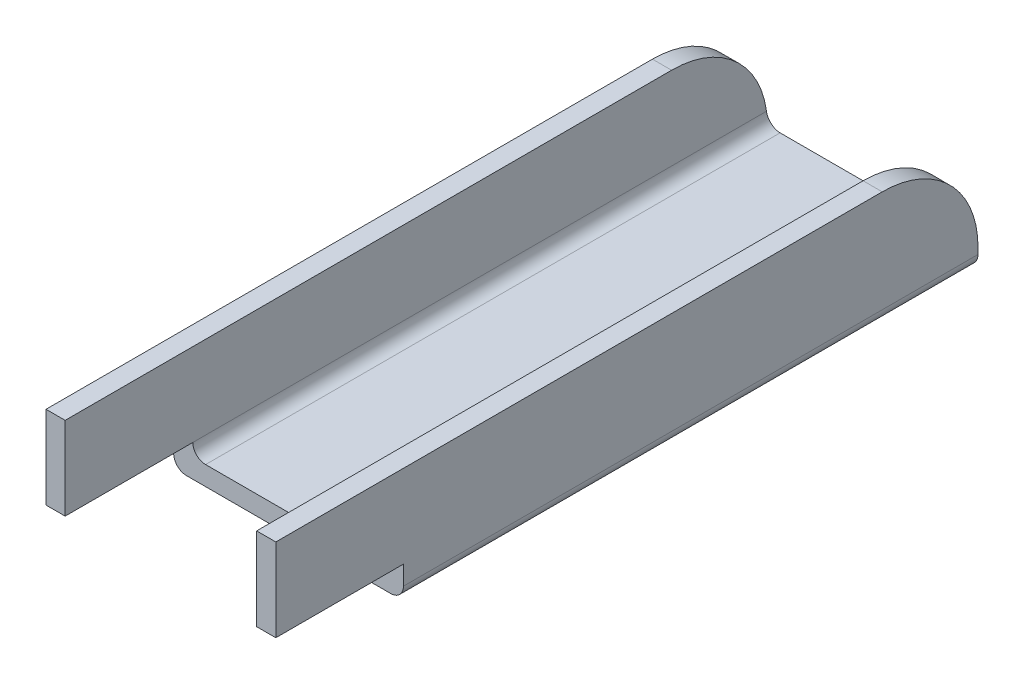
ISO-10303-21;
HEADER;
FILE_DESCRIPTION(('STEP AP214'),'2;1');
FILE_NAME('part.step','',(''),(''),'','','');
FILE_SCHEMA(('AUTOMOTIVE_DESIGN { 1 0 10303 214 1 1 1 1 }'));
ENDSEC;
DATA;
#1=APPLICATION_CONTEXT('core data for automotive mechanical design processes');
#2=APPLICATION_PROTOCOL_DEFINITION('international standard','automotive_design',2000,#1);
#3=PRODUCT_CONTEXT('',#1,'mechanical');
#4=PRODUCT('Part','Part','',(#3));
#5=PRODUCT_RELATED_PRODUCT_CATEGORY('part','',(#4));
#6=PRODUCT_DEFINITION_FORMATION('','',#4);
#7=PRODUCT_DEFINITION_CONTEXT('part definition',#1,'design');
#8=PRODUCT_DEFINITION('design','',#6,#7);
#9=PRODUCT_DEFINITION_SHAPE('','',#8);
#10=(LENGTH_UNIT() NAMED_UNIT(*) SI_UNIT(.MILLI.,.METRE.));
#11=(NAMED_UNIT(*) PLANE_ANGLE_UNIT() SI_UNIT($,.RADIAN.));
#12=(NAMED_UNIT(*) SI_UNIT($,.STERADIAN.) SOLID_ANGLE_UNIT());
#13=UNCERTAINTY_MEASURE_WITH_UNIT(LENGTH_MEASURE(1.E-05),#10,'distance_accuracy_value','');
#14=(GEOMETRIC_REPRESENTATION_CONTEXT(3) GLOBAL_UNCERTAINTY_ASSIGNED_CONTEXT((#13)) GLOBAL_UNIT_ASSIGNED_CONTEXT((#10,
#11,#12)) REPRESENTATION_CONTEXT('',''));
#15=CARTESIAN_POINT('',(0.,0.,0.));
#16=DIRECTION('',(0.,0.,1.));
#17=DIRECTION('',(1.,0.,0.));
#18=AXIS2_PLACEMENT_3D('',#15,#16,#17);
#19=CARTESIAN_POINT('',(33.,15.,0.));
#20=DIRECTION('',(0.,0.,-1.));
#21=DIRECTION('',(-1.,0.,0.));
#22=AXIS2_PLACEMENT_3D('',#19,#20,#21);
#23=PLANE('',#22);
#24=DIRECTION('',(0.,-1.,0.));
#25=VECTOR('',#24,1.);
#26=CARTESIAN_POINT('',(-3.,15.,0.));
#27=LINE('',#26,#25);
#28=CARTESIAN_POINT('',(-3.,15.,0.));
#29=VERTEX_POINT('',#28);
#30=CARTESIAN_POINT('',(-2.99999999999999,2.,0.));
#31=VERTEX_POINT('',#30);
#32=EDGE_CURVE('E193',#29,#31,#27,.T.);
#33=ORIENTED_EDGE('',*,*,#32,.T.);
#34=DIRECTION('',(1.,0.,0.));
#35=VECTOR('',#34,1.);
#36=CARTESIAN_POINT('',(33.,2.,0.));
#37=LINE('',#36,#35);
#38=CARTESIAN_POINT('',(0.,2.,0.));
#39=VERTEX_POINT('',#38);
#40=EDGE_CURVE('E226',#31,#39,#37,.T.);
#41=ORIENTED_EDGE('',*,*,#40,.T.);
#42=DIRECTION('',(0.,-1.,0.));
#43=VECTOR('',#42,1.);
#44=CARTESIAN_POINT('',(0.,15.,0.));
#45=LINE('',#44,#43);
#46=CARTESIAN_POINT('',(0.,15.,0.));
#47=VERTEX_POINT('',#46);
#48=EDGE_CURVE('E209',#47,#39,#45,.T.);
#49=ORIENTED_EDGE('',*,*,#48,.F.);
#50=DIRECTION('',(1.,0.,0.));
#51=VECTOR('',#50,1.);
#52=CARTESIAN_POINT('',(-3.,15.,0.));
#53=LINE('',#52,#51);
#54=EDGE_CURVE('E212',#29,#47,#53,.T.);
#55=ORIENTED_EDGE('',*,*,#54,.F.);
#56=EDGE_LOOP('',(#33,#41,#49,#55));
#57=FACE_BOUND('',#56,.T.);
#58=ADVANCED_FACE('F33',(#57),#23,.F.);
#59=CARTESIAN_POINT('',(33.,0.,-110.));
#60=DIRECTION('',(1.,0.,0.));
#61=DIRECTION('',(0.,0.,-1.));
#62=AXIS2_PLACEMENT_3D('',#59,#60,#61);
#63=PLANE('',#62);
#64=DIRECTION('',(0.,1.,0.));
#65=VECTOR('',#64,1.);
#66=CARTESIAN_POINT('',(33.,0.,-110.));
#67=LINE('',#66,#65);
#68=CARTESIAN_POINT('',(33.,-1.,-110.));
#69=VERTEX_POINT('',#68);
#70=CARTESIAN_POINT('',(33.,0.,-110.));
#71=VERTEX_POINT('',#70);
#72=EDGE_CURVE('E190',#69,#71,#67,.T.);
#73=ORIENTED_EDGE('',*,*,#72,.T.);
#74=CARTESIAN_POINT('',(33.,0.,-95.));
#75=DIRECTION('',(1.,0.,0.));
#76=DIRECTION('',(0.,0.,-1.));
#77=AXIS2_PLACEMENT_3D('',#74,#75,#76);
#78=CIRCLE('',#77,15.);
#79=CARTESIAN_POINT('',(33.,15.,-95.));
#80=VERTEX_POINT('',#79);
#81=EDGE_CURVE('E356',#71,#80,#78,.T.);
#82=ORIENTED_EDGE('',*,*,#81,.T.);
#83=DIRECTION('',(0.,0.,1.));
#84=VECTOR('',#83,1.);
#85=CARTESIAN_POINT('',(33.,15.,-110.));
#86=LINE('',#85,#84);
#87=CARTESIAN_POINT('',(33.,15.,0.));
#88=VERTEX_POINT('',#87);
#89=EDGE_CURVE('E201',#80,#88,#86,.T.);
#90=ORIENTED_EDGE('',*,*,#89,.T.);
#91=DIRECTION('',(0.,1.,0.));
#92=VECTOR('',#91,1.);
#93=CARTESIAN_POINT('',(33.,0.,0.));
#94=LINE('',#93,#92);
#95=CARTESIAN_POINT('',(33.,2.,0.));
#96=VERTEX_POINT('',#95);
#97=EDGE_CURVE('E174',#96,#88,#94,.T.);
#98=ORIENTED_EDGE('',*,*,#97,.F.);
#99=DIRECTION('',(0.,0.,1.));
#100=VECTOR('',#99,1.);
#101=CARTESIAN_POINT('',(33.,2.,0.));
#102=LINE('',#101,#100);
#103=CARTESIAN_POINT('',(33.,2.,-20.));
#104=VERTEX_POINT('',#103);
#105=EDGE_CURVE('E159',#104,#96,#102,.T.);
#106=ORIENTED_EDGE('',*,*,#105,.F.);
#107=DIRECTION('',(0.,1.,0.));
#108=VECTOR('',#107,1.);
#109=CARTESIAN_POINT('',(33.,-3.,-20.));
#110=LINE('',#109,#108);
#111=CARTESIAN_POINT('',(33.,-1.,-20.));
#112=VERTEX_POINT('',#111);
#113=EDGE_CURVE('E150',#112,#104,#110,.T.);
#114=ORIENTED_EDGE('',*,*,#113,.F.);
#115=DIRECTION('',(0.,0.,1.));
#116=VECTOR('',#115,1.);
#117=CARTESIAN_POINT('',(33.,-1.,-110.));
#118=LINE('',#117,#116);
#119=EDGE_CURVE('E241',#112,#69,#118,.F.);
#120=ORIENTED_EDGE('',*,*,#119,.T.);
#121=EDGE_LOOP('',(#73,#82,#90,#98,#106,#114,#120));
#122=FACE_BOUND('',#121,.T.);
#123=ADVANCED_FACE('F172',(#122),#63,.T.);
#124=CARTESIAN_POINT('',(0.,-3.,-110.));
#125=DIRECTION('',(0.,-1.,0.));
#126=DIRECTION('',(0.,0.,-1.));
#127=AXIS2_PLACEMENT_3D('',#124,#125,#126);
#128=PLANE('',#127);
#129=DIRECTION('',(1.,0.,0.));
#130=VECTOR('',#129,1.);
#131=CARTESIAN_POINT('',(0.,-3.,-110.));
#132=LINE('',#131,#130);
#133=CARTESIAN_POINT('',(-1.,-3.,-110.));
#134=VERTEX_POINT('',#133);
#135=CARTESIAN_POINT('',(31.,-3.,-110.));
#136=VERTEX_POINT('',#135);
#137=EDGE_CURVE('E198',#134,#136,#132,.T.);
#138=ORIENTED_EDGE('',*,*,#137,.T.);
#139=DIRECTION('',(0.,0.,1.));
#140=VECTOR('',#139,1.);
#141=CARTESIAN_POINT('',(31.,-3.,-110.));
#142=LINE('',#141,#140);
#143=CARTESIAN_POINT('',(31.,-3.,-20.));
#144=VERTEX_POINT('',#143);
#145=EDGE_CURVE('E237',#136,#144,#142,.T.);
#146=ORIENTED_EDGE('',*,*,#145,.T.);
#147=DIRECTION('',(1.,0.,0.));
#148=VECTOR('',#147,1.);
#149=CARTESIAN_POINT('',(-77.,-3.,-20.));
#150=LINE('',#149,#148);
#151=CARTESIAN_POINT('',(-1.,-3.,-20.));
#152=VERTEX_POINT('',#151);
#153=EDGE_CURVE('E168',#152,#144,#150,.T.);
#154=ORIENTED_EDGE('',*,*,#153,.F.);
#155=DIRECTION('',(0.,0.,1.));
#156=VECTOR('',#155,1.);
#157=CARTESIAN_POINT('',(-1.,-3.,-110.));
#158=LINE('',#157,#156);
#159=EDGE_CURVE('E232',#152,#134,#158,.F.);
#160=ORIENTED_EDGE('',*,*,#159,.T.);
#161=EDGE_LOOP('',(#138,#146,#154,#160));
#162=FACE_BOUND('',#161,.T.);
#163=ADVANCED_FACE('F295',(#162),#128,.T.);
#164=CARTESIAN_POINT('',(-3.,15.,-110.));
#165=DIRECTION('',(-1.,0.,0.));
#166=DIRECTION('',(0.,-1.,0.));
#167=AXIS2_PLACEMENT_3D('',#164,#165,#166);
#168=PLANE('',#167);
#169=DIRECTION('',(0.,0.,1.));
#170=VECTOR('',#169,1.);
#171=CARTESIAN_POINT('',(-3.,15.,-110.));
#172=LINE('',#171,#170);
#173=CARTESIAN_POINT('',(-3.,15.,-95.));
#174=VERTEX_POINT('',#173);
#175=EDGE_CURVE('E217',#174,#29,#172,.T.);
#176=ORIENTED_EDGE('',*,*,#175,.F.);
#177=CARTESIAN_POINT('',(-3.,0.,-95.));
#178=DIRECTION('',(-1.,0.,0.));
#179=DIRECTION('',(0.,-1.,0.));
#180=AXIS2_PLACEMENT_3D('',#177,#178,#179);
#181=CIRCLE('',#180,15.);
#182=CARTESIAN_POINT('',(-3.,0.,-110.));
#183=VERTEX_POINT('',#182);
#184=EDGE_CURVE('E357',#174,#183,#181,.T.);
#185=ORIENTED_EDGE('',*,*,#184,.T.);
#186=DIRECTION('',(0.,-1.,0.));
#187=VECTOR('',#186,1.);
#188=CARTESIAN_POINT('',(-3.,15.,-110.));
#189=LINE('',#188,#187);
#190=CARTESIAN_POINT('',(-3.,-1.,-110.));
#191=VERTEX_POINT('',#190);
#192=EDGE_CURVE('E196',#183,#191,#189,.T.);
#193=ORIENTED_EDGE('',*,*,#192,.T.);
#194=DIRECTION('',(0.,0.,1.));
#195=VECTOR('',#194,1.);
#196=CARTESIAN_POINT('',(-3.,-1.,-110.));
#197=LINE('',#196,#195);
#198=CARTESIAN_POINT('',(-3.,-1.,-20.));
#199=VERTEX_POINT('',#198);
#200=EDGE_CURVE('E227',#191,#199,#197,.T.);
#201=ORIENTED_EDGE('',*,*,#200,.T.);
#202=DIRECTION('',(0.,-1.,0.));
#203=VECTOR('',#202,1.);
#204=CARTESIAN_POINT('',(-3.,15.,-20.));
#205=LINE('',#204,#203);
#206=CARTESIAN_POINT('',(-3.,2.,-20.));
#207=VERTEX_POINT('',#206);
#208=EDGE_CURVE('E187',#207,#199,#205,.T.);
#209=ORIENTED_EDGE('',*,*,#208,.F.);
#210=DIRECTION('',(0.,0.,-1.));
#211=VECTOR('',#210,1.);
#212=CARTESIAN_POINT('',(-3.,2.,-110.));
#213=LINE('',#212,#211);
#214=EDGE_CURVE('E182',#31,#207,#213,.T.);
#215=ORIENTED_EDGE('',*,*,#214,.F.);
#216=ORIENTED_EDGE('',*,*,#32,.F.);
#217=EDGE_LOOP('',(#176,#185,#193,#201,#209,#215,#216));
#218=FACE_BOUND('',#217,.T.);
#219=ADVANCED_FACE('F337',(#218),#168,.T.);
#220=CARTESIAN_POINT('',(-3.,15.,-110.));
#221=DIRECTION('',(0.,-1.,0.));
#222=DIRECTION('',(0.,0.,-1.));
#223=AXIS2_PLACEMENT_3D('',#220,#221,#222);
#224=PLANE('',#223);
#225=DIRECTION('',(0.,0.,1.));
#226=VECTOR('',#225,1.);
#227=CARTESIAN_POINT('',(0.,15.,-110.));
#228=LINE('',#227,#226);
#229=CARTESIAN_POINT('',(0.,15.,-95.));
#230=VERTEX_POINT('',#229);
#231=EDGE_CURVE('E220',#230,#47,#228,.T.);
#232=ORIENTED_EDGE('',*,*,#231,.F.);
#233=DIRECTION('',(1.,0.,0.));
#234=VECTOR('',#233,1.);
#235=CARTESIAN_POINT('',(-3.,15.,-95.));
#236=LINE('',#235,#234);
#237=EDGE_CURVE('E360',#230,#174,#236,.F.);
#238=ORIENTED_EDGE('',*,*,#237,.T.);
#239=ORIENTED_EDGE('',*,*,#175,.T.);
#240=ORIENTED_EDGE('',*,*,#54,.T.);
#241=EDGE_LOOP('',(#232,#238,#239,#240));
#242=FACE_BOUND('',#241,.T.);
#243=ADVANCED_FACE('F365',(#242),#224,.F.);
#244=CARTESIAN_POINT('',(0.,15.,-110.));
#245=DIRECTION('',(-1.,0.,0.));
#246=DIRECTION('',(0.,-1.,0.));
#247=AXIS2_PLACEMENT_3D('',#244,#245,#246);
#248=PLANE('',#247);
#249=DIRECTION('',(0.,0.,1.));
#250=VECTOR('',#249,1.);
#251=CARTESIAN_POINT('',(0.,2.,-110.));
#252=LINE('',#251,#250);
#253=CARTESIAN_POINT('',(0.,2.,-20.));
#254=VERTEX_POINT('',#253);
#255=CARTESIAN_POINT('',(0.,2.,-109.866068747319));
#256=VERTEX_POINT('',#255);
#257=EDGE_CURVE('E248',#254,#256,#252,.F.);
#258=ORIENTED_EDGE('',*,*,#257,.T.);
#259=CARTESIAN_POINT('',(0.,0.,-95.));
#260=DIRECTION('',(-1.,0.,0.));
#261=DIRECTION('',(0.,-1.,0.));
#262=AXIS2_PLACEMENT_3D('',#259,#260,#261);
#263=CIRCLE('',#262,15.);
#264=EDGE_CURVE('E269',#256,#230,#263,.F.);
#265=ORIENTED_EDGE('',*,*,#264,.T.);
#266=ORIENTED_EDGE('',*,*,#231,.T.);
#267=ORIENTED_EDGE('',*,*,#48,.T.);
#268=DIRECTION('',(0.,0.,-1.));
#269=VECTOR('',#268,1.);
#270=CARTESIAN_POINT('',(0.,2.,-110.));
#271=LINE('',#270,#269);
#272=EDGE_CURVE('E179',#39,#254,#271,.T.);
#273=ORIENTED_EDGE('',*,*,#272,.T.);
#274=EDGE_LOOP('',(#258,#265,#266,#267,#273));
#275=FACE_BOUND('',#274,.T.);
#276=ADVANCED_FACE('F329',(#275),#248,.F.);
#277=CARTESIAN_POINT('',(0.,0.,-110.));
#278=DIRECTION('',(0.,-1.,0.));
#279=DIRECTION('',(0.,0.,-1.));
#280=AXIS2_PLACEMENT_3D('',#277,#278,#279);
#281=PLANE('',#280);
#282=DIRECTION('',(1.,0.,0.));
#283=VECTOR('',#282,1.);
#284=CARTESIAN_POINT('',(0.,0.,-20.));
#285=LINE('',#284,#283);
#286=CARTESIAN_POINT('',(2.,0.,-20.));
#287=VERTEX_POINT('',#286);
#288=CARTESIAN_POINT('',(28.,0.,-20.));
#289=VERTEX_POINT('',#288);
#290=EDGE_CURVE('E184',#287,#289,#285,.T.);
#291=ORIENTED_EDGE('',*,*,#290,.T.);
#292=DIRECTION('',(0.,0.,1.));
#293=VECTOR('',#292,1.);
#294=CARTESIAN_POINT('',(28.,0.,-110.));
#295=LINE('',#294,#293);
#296=CARTESIAN_POINT('',(28.,0.,-110.));
#297=VERTEX_POINT('',#296);
#298=EDGE_CURVE('E255',#289,#297,#295,.F.);
#299=ORIENTED_EDGE('',*,*,#298,.T.);
#300=DIRECTION('',(1.,0.,0.));
#301=VECTOR('',#300,1.);
#302=CARTESIAN_POINT('',(0.,0.,-110.));
#303=LINE('',#302,#301);
#304=CARTESIAN_POINT('',(2.,0.,-110.));
#305=VERTEX_POINT('',#304);
#306=EDGE_CURVE('E192',#305,#297,#303,.T.);
#307=ORIENTED_EDGE('',*,*,#306,.F.);
#308=DIRECTION('',(0.,0.,1.));
#309=VECTOR('',#308,1.);
#310=CARTESIAN_POINT('',(2.,0.,-20.));
#311=LINE('',#310,#309);
#312=EDGE_CURVE('E245',#305,#287,#311,.T.);
#313=ORIENTED_EDGE('',*,*,#312,.T.);
#314=EDGE_LOOP('',(#291,#299,#307,#313));
#315=FACE_BOUND('',#314,.T.);
#316=ADVANCED_FACE('F318',(#315),#281,.F.);
#317=CARTESIAN_POINT('',(30.,0.,-110.));
#318=DIRECTION('',(1.,0.,0.));
#319=DIRECTION('',(0.,0.,-1.));
#320=AXIS2_PLACEMENT_3D('',#317,#318,#319);
#321=PLANE('',#320);
#322=DIRECTION('',(0.,0.,1.));
#323=VECTOR('',#322,1.);
#324=CARTESIAN_POINT('',(30.,15.,-110.));
#325=LINE('',#324,#323);
#326=CARTESIAN_POINT('',(30.,15.,-95.));
#327=VERTEX_POINT('',#326);
#328=CARTESIAN_POINT('',(30.,15.,0.));
#329=VERTEX_POINT('',#328);
#330=EDGE_CURVE('E222',#327,#329,#325,.T.);
#331=ORIENTED_EDGE('',*,*,#330,.F.);
#332=CARTESIAN_POINT('',(30.,0.,-95.));
#333=DIRECTION('',(1.,0.,0.));
#334=DIRECTION('',(0.,0.,-1.));
#335=AXIS2_PLACEMENT_3D('',#332,#333,#334);
#336=CIRCLE('',#335,15.);
#337=CARTESIAN_POINT('',(30.,2.,-109.866068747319));
#338=VERTEX_POINT('',#337);
#339=EDGE_CURVE('E46',#327,#338,#336,.F.);
#340=ORIENTED_EDGE('',*,*,#339,.T.);
#341=DIRECTION('',(0.,0.,1.));
#342=VECTOR('',#341,1.);
#343=CARTESIAN_POINT('',(30.,2.,-20.));
#344=LINE('',#343,#342);
#345=CARTESIAN_POINT('',(30.,2.,-20.));
#346=VERTEX_POINT('',#345);
#347=EDGE_CURVE('E253',#338,#346,#344,.T.);
#348=ORIENTED_EDGE('',*,*,#347,.T.);
#349=DIRECTION('',(0.,0.,1.));
#350=VECTOR('',#349,1.);
#351=CARTESIAN_POINT('',(30.,2.,-110.));
#352=LINE('',#351,#350);
#353=CARTESIAN_POINT('',(30.,2.,0.));
#354=VERTEX_POINT('',#353);
#355=EDGE_CURVE('E166',#346,#354,#352,.T.);
#356=ORIENTED_EDGE('',*,*,#355,.T.);
#357=DIRECTION('',(0.,1.,0.));
#358=VECTOR('',#357,1.);
#359=CARTESIAN_POINT('',(30.,0.,0.));
#360=LINE('',#359,#358);
#361=EDGE_CURVE('E206',#354,#329,#360,.T.);
#362=ORIENTED_EDGE('',*,*,#361,.T.);
#363=EDGE_LOOP('',(#331,#340,#348,#356,#362));
#364=FACE_BOUND('',#363,.T.);
#365=ADVANCED_FACE('F312',(#364),#321,.F.);
#366=CARTESIAN_POINT('',(30.,15.,-110.));
#367=DIRECTION('',(0.,-1.,0.));
#368=DIRECTION('',(0.,0.,-1.));
#369=AXIS2_PLACEMENT_3D('',#366,#367,#368);
#370=PLANE('',#369);
#371=ORIENTED_EDGE('',*,*,#89,.F.);
#372=DIRECTION('',(1.,0.,0.));
#373=VECTOR('',#372,1.);
#374=CARTESIAN_POINT('',(30.,15.,-95.));
#375=LINE('',#374,#373);
#376=EDGE_CURVE('E60',#80,#327,#375,.F.);
#377=ORIENTED_EDGE('',*,*,#376,.T.);
#378=ORIENTED_EDGE('',*,*,#330,.T.);
#379=DIRECTION('',(1.,0.,0.));
#380=VECTOR('',#379,1.);
#381=CARTESIAN_POINT('',(30.,15.,0.));
#382=LINE('',#381,#380);
#383=EDGE_CURVE('E203',#329,#88,#382,.T.);
#384=ORIENTED_EDGE('',*,*,#383,.T.);
#385=EDGE_LOOP('',(#371,#377,#378,#384));
#386=FACE_BOUND('',#385,.T.);
#387=ADVANCED_FACE('F308',(#386),#370,.F.);
#388=CARTESIAN_POINT('',(33.,15.,-110.));
#389=DIRECTION('',(0.,0.,-1.));
#390=DIRECTION('',(-1.,0.,0.));
#391=AXIS2_PLACEMENT_3D('',#388,#389,#390);
#392=PLANE('',#391);
#393=ORIENTED_EDGE('',*,*,#306,.T.);
#394=DIRECTION('',(1.,0.,0.));
#395=VECTOR('',#394,1.);
#396=CARTESIAN_POINT('',(33.,0.,-110.));
#397=LINE('',#396,#395);
#398=EDGE_CURVE('E354',#297,#71,#397,.T.);
#399=ORIENTED_EDGE('',*,*,#398,.T.);
#400=ORIENTED_EDGE('',*,*,#72,.F.);
#401=CARTESIAN_POINT('',(31.,-1.,-110.));
#402=DIRECTION('',(0.,0.,-1.));
#403=DIRECTION('',(-1.,0.,0.));
#404=AXIS2_PLACEMENT_3D('',#401,#402,#403);
#405=CIRCLE('',#404,2.);
#406=EDGE_CURVE('E243',#69,#136,#405,.T.);
#407=ORIENTED_EDGE('',*,*,#406,.T.);
#408=ORIENTED_EDGE('',*,*,#137,.F.);
#409=CARTESIAN_POINT('',(-1.,-1.,-110.));
#410=DIRECTION('',(0.,0.,-1.));
#411=DIRECTION('',(-1.,0.,0.));
#412=AXIS2_PLACEMENT_3D('',#409,#410,#411);
#413=CIRCLE('',#412,2.);
#414=EDGE_CURVE('E234',#134,#191,#413,.T.);
#415=ORIENTED_EDGE('',*,*,#414,.T.);
#416=ORIENTED_EDGE('',*,*,#192,.F.);
#417=DIRECTION('',(1.,0.,0.));
#418=VECTOR('',#417,1.);
#419=CARTESIAN_POINT('',(0.,0.,-110.));
#420=LINE('',#419,#418);
#421=EDGE_CURVE('E260',#183,#305,#420,.T.);
#422=ORIENTED_EDGE('',*,*,#421,.T.);
#423=EDGE_LOOP('',(#393,#399,#400,#407,#408,#415,#416,#422));
#424=FACE_BOUND('',#423,.T.);
#425=ADVANCED_FACE('F300',(#424),#392,.T.);
#426=ORIENTED_EDGE('',*,*,#361,.F.);
#427=EDGE_CURVE('E219',#354,#96,#37,.T.);
#428=ORIENTED_EDGE('',*,*,#427,.T.);
#429=ORIENTED_EDGE('',*,*,#97,.T.);
#430=ORIENTED_EDGE('',*,*,#383,.F.);
#431=EDGE_LOOP('',(#426,#428,#429,#430));
#432=FACE_BOUND('',#431,.T.);
#433=ADVANCED_FACE('F291',(#432),#23,.F.);
#434=CARTESIAN_POINT('',(-77.,-3.,-20.));
#435=DIRECTION('',(0.,0.,-1.));
#436=DIRECTION('',(-1.,0.,0.));
#437=AXIS2_PLACEMENT_3D('',#434,#435,#436);
#438=PLANE('',#437);
#439=ORIENTED_EDGE('',*,*,#153,.T.);
#440=CARTESIAN_POINT('',(31.,-1.,-20.));
#441=DIRECTION('',(0.,0.,-1.));
#442=DIRECTION('',(-1.,0.,0.));
#443=AXIS2_PLACEMENT_3D('',#440,#441,#442);
#444=CIRCLE('',#443,2.);
#445=EDGE_CURVE('E155',#144,#112,#444,.F.);
#446=ORIENTED_EDGE('',*,*,#445,.T.);
#447=ORIENTED_EDGE('',*,*,#113,.T.);
#448=DIRECTION('',(1.,0.,0.));
#449=VECTOR('',#448,1.);
#450=CARTESIAN_POINT('',(-77.,2.,-20.));
#451=LINE('',#450,#449);
#452=EDGE_CURVE('E154',#346,#104,#451,.T.);
#453=ORIENTED_EDGE('',*,*,#452,.F.);
#454=CARTESIAN_POINT('',(28.,2.,-20.));
#455=DIRECTION('',(0.,0.,-1.));
#456=DIRECTION('',(-1.,0.,0.));
#457=AXIS2_PLACEMENT_3D('',#454,#455,#456);
#458=CIRCLE('',#457,2.);
#459=EDGE_CURVE('E258',#346,#289,#458,.T.);
#460=ORIENTED_EDGE('',*,*,#459,.T.);
#461=ORIENTED_EDGE('',*,*,#290,.F.);
#462=CARTESIAN_POINT('',(2.,2.,-20.));
#463=DIRECTION('',(0.,0.,-1.));
#464=DIRECTION('',(-1.,0.,0.));
#465=AXIS2_PLACEMENT_3D('',#462,#463,#464);
#466=CIRCLE('',#465,2.);
#467=EDGE_CURVE('E251',#287,#254,#466,.T.);
#468=ORIENTED_EDGE('',*,*,#467,.T.);
#469=EDGE_CURVE('E167',#207,#254,#451,.T.);
#470=ORIENTED_EDGE('',*,*,#469,.F.);
#471=ORIENTED_EDGE('',*,*,#208,.T.);
#472=CARTESIAN_POINT('',(-1.,-1.,-20.));
#473=DIRECTION('',(0.,0.,-1.));
#474=DIRECTION('',(-1.,0.,0.));
#475=AXIS2_PLACEMENT_3D('',#472,#473,#474);
#476=CIRCLE('',#475,2.);
#477=EDGE_CURVE('E230',#199,#152,#476,.F.);
#478=ORIENTED_EDGE('',*,*,#477,.T.);
#479=EDGE_LOOP('',(#439,#446,#447,#453,#460,#461,#468,#470,#471,#478));
#480=FACE_BOUND('',#479,.T.);
#481=ADVANCED_FACE('F153',(#480),#438,.F.);
#482=CARTESIAN_POINT('',(-77.,2.,0.));
#483=DIRECTION('',(0.,1.,0.));
#484=DIRECTION('',(0.,0.,1.));
#485=AXIS2_PLACEMENT_3D('',#482,#483,#484);
#486=PLANE('',#485);
#487=ORIENTED_EDGE('',*,*,#214,.T.);
#488=ORIENTED_EDGE('',*,*,#469,.T.);
#489=ORIENTED_EDGE('',*,*,#272,.F.);
#490=ORIENTED_EDGE('',*,*,#40,.F.);
#491=EDGE_LOOP('',(#487,#488,#489,#490));
#492=FACE_BOUND('',#491,.T.);
#493=ADVANCED_FACE('F306',(#492),#486,.F.);
#494=ORIENTED_EDGE('',*,*,#452,.T.);
#495=ORIENTED_EDGE('',*,*,#105,.T.);
#496=ORIENTED_EDGE('',*,*,#427,.F.);
#497=ORIENTED_EDGE('',*,*,#355,.F.);
#498=EDGE_LOOP('',(#494,#495,#496,#497));
#499=FACE_BOUND('',#498,.T.);
#500=ADVANCED_FACE('F163',(#499),#486,.F.);
#501=CARTESIAN_POINT('',(-1.,-1.,-110.));
#502=DIRECTION('',(0.,0.,1.));
#503=DIRECTION('',(1.,0.,0.));
#504=AXIS2_PLACEMENT_3D('',#501,#502,#503);
#505=CYLINDRICAL_SURFACE('',#504,2.);
#506=ORIENTED_EDGE('',*,*,#414,.F.);
#507=ORIENTED_EDGE('',*,*,#159,.F.);
#508=ORIENTED_EDGE('',*,*,#477,.F.);
#509=ORIENTED_EDGE('',*,*,#200,.F.);
#510=EDGE_LOOP('',(#506,#507,#508,#509));
#511=FACE_BOUND('',#510,.T.);
#512=ADVANCED_FACE('F346',(#511),#505,.T.);
#513=CARTESIAN_POINT('',(31.,-1.,-110.));
#514=DIRECTION('',(0.,0.,1.));
#515=DIRECTION('',(1.,0.,0.));
#516=AXIS2_PLACEMENT_3D('',#513,#514,#515);
#517=CYLINDRICAL_SURFACE('',#516,2.);
#518=ORIENTED_EDGE('',*,*,#406,.F.);
#519=ORIENTED_EDGE('',*,*,#119,.F.);
#520=ORIENTED_EDGE('',*,*,#445,.F.);
#521=ORIENTED_EDGE('',*,*,#145,.F.);
#522=EDGE_LOOP('',(#518,#519,#520,#521));
#523=FACE_BOUND('',#522,.T.);
#524=ADVANCED_FACE('F278',(#523),#517,.T.);
#525=CARTESIAN_POINT('',(2.,2.,-110.));
#526=DIRECTION('',(0.,0.,-1.));
#527=DIRECTION('',(-1.,0.,0.));
#528=AXIS2_PLACEMENT_3D('',#525,#526,#527);
#529=CYLINDRICAL_SURFACE('',#528,2.);
#530=ORIENTED_EDGE('',*,*,#312,.F.);
#531=CARTESIAN_POINT('',(2.,0.,-110.));
#532=CARTESIAN_POINT('',(1.94374039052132,3.75480187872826E-07,-109.999998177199));
#533=CARTESIAN_POINT('',(1.88750773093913,0.00237534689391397,-110.00000020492));
#534=CARTESIAN_POINT('',(1.77544462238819,0.0118500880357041,-109.999996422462));
#535=CARTESIAN_POINT('',(1.71961415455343,0.0189496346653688,-109.999990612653));
#536=CARTESIAN_POINT('',(1.55341997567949,0.0472683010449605,-109.999938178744));
#537=CARTESIAN_POINT('',(1.44416915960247,0.0755076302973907,-109.999856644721));
#538=CARTESIAN_POINT('',(1.23196064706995,0.149923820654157,-109.999296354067));
#539=CARTESIAN_POINT('',(1.12900606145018,0.196109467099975,-109.998817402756));
#540=CARTESIAN_POINT('',(0.93231806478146,0.305099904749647,-109.996995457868));
#541=CARTESIAN_POINT('',(0.838583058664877,0.367901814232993,-109.995652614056));
#542=CARTESIAN_POINT('',(0.663070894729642,0.5082756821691,-109.99154987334));
#543=CARTESIAN_POINT('',(0.581284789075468,0.585836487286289,-109.988791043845));
#544=CARTESIAN_POINT('',(0.431901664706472,0.753534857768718,-109.981295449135));
#545=CARTESIAN_POINT('',(0.364306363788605,0.843673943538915,-109.976558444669));
#546=CARTESIAN_POINT('',(0.245409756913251,1.03359778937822,-109.964648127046));
#547=CARTESIAN_POINT('',(0.194061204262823,1.13335345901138,-109.957482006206));
#548=CARTESIAN_POINT('',(0.108804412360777,1.33982062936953,-109.940401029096));
#549=CARTESIAN_POINT('',(0.0748881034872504,1.44652888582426,-109.93048744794));
#550=CARTESIAN_POINT('',(0.0334270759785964,1.62821337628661,-109.9115503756));
#551=CARTESIAN_POINT('',(0.0208871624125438,1.70217094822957,-109.903293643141));
#552=CARTESIAN_POINT('',(0.0041741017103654,1.8507697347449,-109.885573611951));
#553=CARTESIAN_POINT('',(-1.15014222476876E-05,1.92540976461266,-109.8761121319));
#554=CARTESIAN_POINT('',(0.,2.,-109.866068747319));
#555=B_SPLINE_CURVE_WITH_KNOTS('',3,(#531,#532,#533,#534,#535,#536,#537,#538,#539,#540,#541,
#542,#543,#544,#545,#546,#547,#548,#549,#550,#551,#552,#553,#554),.UNSPECIFIED.,.F.,.F.,(4,2,2,
2,2,2,2,2,2,2,2,4),(0.,0.168675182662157,0.337342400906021,0.674130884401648,1.01108444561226,
1.34797960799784,1.68462118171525,2.0213034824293,2.35699749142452,2.69253596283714,
2.91848729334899,3.14410148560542),.UNSPECIFIED.);
#556=EDGE_CURVE('E263',#305,#256,#555,.T.);
#557=ORIENTED_EDGE('',*,*,#556,.T.);
#558=ORIENTED_EDGE('',*,*,#257,.F.);
#559=ORIENTED_EDGE('',*,*,#467,.F.);
#560=EDGE_LOOP('',(#530,#557,#558,#559));
#561=FACE_BOUND('',#560,.T.);
#562=ADVANCED_FACE('F273',(#561),#529,.F.);
#563=CARTESIAN_POINT('',(28.,2.,-110.));
#564=DIRECTION('',(0.,0.,-1.));
#565=DIRECTION('',(-1.,0.,0.));
#566=AXIS2_PLACEMENT_3D('',#563,#564,#565);
#567=CYLINDRICAL_SURFACE('',#566,2.);
#568=ORIENTED_EDGE('',*,*,#347,.F.);
#569=CARTESIAN_POINT('',(30.,2.,-109.866068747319));
#570=CARTESIAN_POINT('',(29.9999996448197,1.94428057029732,-109.873566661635));
#571=CARTESIAN_POINT('',(29.9976699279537,1.88854367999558,-109.880744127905));
#572=CARTESIAN_POINT('',(29.9883545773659,1.77737752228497,-109.894430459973));
#573=CARTESIAN_POINT('',(29.9813688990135,1.72194825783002,-109.900939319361));
#574=CARTESIAN_POINT('',(29.9534607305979,1.55680617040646,-109.919402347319));
#575=CARTESIAN_POINT('',(29.9255870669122,1.44806623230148,-109.930316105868));
#576=CARTESIAN_POINT('',(29.8519403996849,1.23653030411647,-109.949324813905));
#577=CARTESIAN_POINT('',(29.806153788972,1.13373890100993,-109.957417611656));
#578=CARTESIAN_POINT('',(29.6979268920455,0.937163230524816,-109.971019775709));
#579=CARTESIAN_POINT('',(29.6354910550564,0.843376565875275,-109.976529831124));
#580=CARTESIAN_POINT('',(29.4960464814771,0.667954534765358,-109.985377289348));
#581=CARTESIAN_POINT('',(29.4191067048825,0.586264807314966,-109.988724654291));
#582=CARTESIAN_POINT('',(29.2526162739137,0.436841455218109,-109.993824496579));
#583=CARTESIAN_POINT('',(29.1630627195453,0.369111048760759,-109.995576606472));
#584=CARTESIAN_POINT('',(28.9736942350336,0.249429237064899,-109.998046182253));
#585=CARTESIAN_POINT('',(28.8738574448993,0.197512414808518,-109.998761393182));
#586=CARTESIAN_POINT('',(28.6669190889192,0.111145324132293,-109.999650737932));
#587=CARTESIAN_POINT('',(28.5598214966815,0.0766855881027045,-109.999825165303));
#588=CARTESIAN_POINT('',(28.3767826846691,0.0343461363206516,-109.99997045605));
#589=CARTESIAN_POINT('',(28.3019570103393,0.0214755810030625,-109.999988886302));
#590=CARTESIAN_POINT('',(28.151431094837,0.00430258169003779,-110.00000004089));
#591=CARTESIAN_POINT('',(28.0757321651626,-1.13618963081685E-05,-109.999992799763));
#592=CARTESIAN_POINT('',(28.,0.,-110.));
#593=B_SPLINE_CURVE_WITH_KNOTS('',3,(#569,#570,#571,#572,#573,#574,#575,#576,#577,#578,#579,
#580,#581,#582,#583,#584,#585,#586,#587,#588,#589,#590,#591,#592),.UNSPECIFIED.,.F.,.F.,(4,2,2,
2,2,2,2,2,2,2,2,4),(0.,0.168564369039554,0.33713035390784,0.673745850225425,1.01061754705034,
1.34739931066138,1.68261846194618,2.01791480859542,2.35393924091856,2.68978123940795,
2.91709622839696,3.14410551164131),.UNSPECIFIED.);
#594=EDGE_CURVE('E11',#338,#297,#593,.T.);
#595=ORIENTED_EDGE('',*,*,#594,.T.);
#596=ORIENTED_EDGE('',*,*,#298,.F.);
#597=ORIENTED_EDGE('',*,*,#459,.F.);
#598=EDGE_LOOP('',(#568,#595,#596,#597));
#599=FACE_BOUND('',#598,.T.);
#600=ADVANCED_FACE('F277',(#599),#567,.F.);
#601=CARTESIAN_POINT('',(33.,0.,-95.));
#602=DIRECTION('',(-1.,0.,0.));
#603=DIRECTION('',(0.,0.,1.));
#604=AXIS2_PLACEMENT_3D('',#601,#602,#603);
#605=CYLINDRICAL_SURFACE('',#604,15.);
#606=ORIENTED_EDGE('',*,*,#184,.F.);
#607=ORIENTED_EDGE('',*,*,#237,.F.);
#608=ORIENTED_EDGE('',*,*,#264,.F.);
#609=ORIENTED_EDGE('',*,*,#556,.F.);
#610=ORIENTED_EDGE('',*,*,#421,.F.);
#611=EDGE_LOOP('',(#606,#607,#608,#609,#610));
#612=FACE_BOUND('',#611,.T.);
#613=ADVANCED_FACE('F271',(#612),#605,.T.);
#614=CARTESIAN_POINT('',(33.,0.,-95.));
#615=DIRECTION('',(-1.,0.,0.));
#616=DIRECTION('',(0.,0.,1.));
#617=AXIS2_PLACEMENT_3D('',#614,#615,#616);
#618=CYLINDRICAL_SURFACE('',#617,15.);
#619=ORIENTED_EDGE('',*,*,#339,.F.);
#620=ORIENTED_EDGE('',*,*,#376,.F.);
#621=ORIENTED_EDGE('',*,*,#81,.F.);
#622=ORIENTED_EDGE('',*,*,#398,.F.);
#623=ORIENTED_EDGE('',*,*,#594,.F.);
#624=EDGE_LOOP('',(#619,#620,#621,#622,#623));
#625=FACE_BOUND('',#624,.T.);
#626=ADVANCED_FACE('F35',(#625),#618,.T.);
#627=CLOSED_SHELL('',(#58,#123,#163,#219,#243,#276,#316,#365,#387,#425,#433,#481,#493,#500,#512,
#524,#562,#600,#613,#626));
#628=MANIFOLD_SOLID_BREP('B2',#627);
#629=ADVANCED_BREP_SHAPE_REPRESENTATION('',(#18,#628),#14);
#630=SHAPE_DEFINITION_REPRESENTATION(#9,#629);
ENDSEC;
END-ISO-10303-21;
